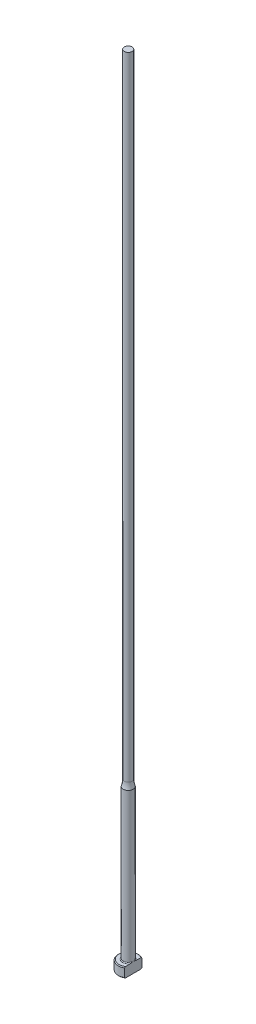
ISO-10303-21;
HEADER;
FILE_DESCRIPTION(('STEP AP214'),'2;1');
FILE_NAME('part.step','',(''),(''),'','','');
FILE_SCHEMA(('AUTOMOTIVE_DESIGN { 1 0 10303 214 1 1 1 1 }'));
ENDSEC;
DATA;
#1=APPLICATION_CONTEXT('core data for automotive mechanical design processes');
#2=APPLICATION_PROTOCOL_DEFINITION('international standard','automotive_design',2000,#1);
#3=PRODUCT_CONTEXT('',#1,'mechanical');
#4=PRODUCT('Part','Part','',(#3));
#5=PRODUCT_RELATED_PRODUCT_CATEGORY('part','',(#4));
#6=PRODUCT_DEFINITION_FORMATION('','',#4);
#7=PRODUCT_DEFINITION_CONTEXT('part definition',#1,'design');
#8=PRODUCT_DEFINITION('design','',#6,#7);
#9=PRODUCT_DEFINITION_SHAPE('','',#8);
#10=(LENGTH_UNIT() NAMED_UNIT(*) SI_UNIT(.MILLI.,.METRE.));
#11=(NAMED_UNIT(*) PLANE_ANGLE_UNIT() SI_UNIT($,.RADIAN.));
#12=(NAMED_UNIT(*) SI_UNIT($,.STERADIAN.) SOLID_ANGLE_UNIT());
#13=UNCERTAINTY_MEASURE_WITH_UNIT(LENGTH_MEASURE(1.E-05),#10,'distance_accuracy_value','');
#14=(GEOMETRIC_REPRESENTATION_CONTEXT(3) GLOBAL_UNCERTAINTY_ASSIGNED_CONTEXT((#13)) GLOBAL_UNIT_ASSIGNED_CONTEXT((#10,
#11,#12)) REPRESENTATION_CONTEXT('',''));
#15=CARTESIAN_POINT('',(0.,0.,0.));
#16=DIRECTION('',(0.,0.,1.));
#17=DIRECTION('',(1.,0.,0.));
#18=AXIS2_PLACEMENT_3D('',#15,#16,#17);
#19=CARTESIAN_POINT('',(-3.17499999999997,3.175,0.));
#20=DIRECTION('',(0.,1.,0.));
#21=DIRECTION('',(0.,0.,1.));
#22=AXIS2_PLACEMENT_3D('',#19,#20,#21);
#23=PLANE('',#22);
#24=CARTESIAN_POINT('',(0.,3.175,0.));
#25=DIRECTION('',(0.,1.,0.));
#26=DIRECTION('',(0.,0.,1.));
#27=AXIS2_PLACEMENT_3D('',#24,#25,#26);
#28=CIRCLE('',#27,2.92099999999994);
#29=CARTESIAN_POINT('',(1.58749999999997,3.175,-2.45195529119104));
#30=VERTEX_POINT('',#29);
#31=CARTESIAN_POINT('',(1.58749999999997,3.175,2.45195529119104));
#32=VERTEX_POINT('',#31);
#33=EDGE_CURVE('E105',#30,#32,#28,.T.);
#34=ORIENTED_EDGE('',*,*,#33,.T.);
#35=DIRECTION('',(0.,0.,1.));
#36=VECTOR('',#35,1.);
#37=CARTESIAN_POINT('',(1.58749999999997,3.17499999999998,2.74963065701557));
#38=LINE('',#37,#36);
#39=CARTESIAN_POINT('',(1.58749999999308,3.175,0.933255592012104));
#40=VERTEX_POINT('',#39);
#41=EDGE_CURVE('E126',#40,#32,#38,.T.);
#42=ORIENTED_EDGE('',*,*,#41,.F.);
#43=CARTESIAN_POINT('',(0.,3.175,0.));
#44=DIRECTION('',(0.,1.,0.));
#45=DIRECTION('',(0.,0.,1.));
#46=AXIS2_PLACEMENT_3D('',#43,#44,#45);
#47=CIRCLE('',#46,1.84149999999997);
#48=CARTESIAN_POINT('',(1.58749999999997,3.17500000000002,-0.933255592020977));
#49=VERTEX_POINT('',#48);
#50=EDGE_CURVE('E11',#40,#49,#47,.F.);
#51=ORIENTED_EDGE('',*,*,#50,.T.);
#52=EDGE_CURVE('E52',#30,#49,#38,.T.);
#53=ORIENTED_EDGE('',*,*,#52,.F.);
#54=EDGE_LOOP('',(#34,#42,#51,#53));
#55=FACE_BOUND('',#54,.T.);
#56=ADVANCED_FACE('F32',(#55),#23,.T.);
#57=CARTESIAN_POINT('',(0.,259.958771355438,0.));
#58=DIRECTION('',(0.,1.,0.));
#59=DIRECTION('',(0.,0.,1.));
#60=AXIS2_PLACEMENT_3D('',#57,#58,#59);
#61=CYLINDRICAL_SURFACE('',#60,3.17499999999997);
#62=CARTESIAN_POINT('',(0.,2.92100000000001,0.));
#63=DIRECTION('',(0.,1.,0.));
#64=DIRECTION('',(0.,0.,1.));
#65=AXIS2_PLACEMENT_3D('',#62,#63,#64);
#66=CIRCLE('',#65,3.17499999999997);
#67=CARTESIAN_POINT('',(1.58749999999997,2.92100000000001,2.74963065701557));
#68=VERTEX_POINT('',#67);
#69=CARTESIAN_POINT('',(1.58749999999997,2.92100000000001,-2.74963065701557));
#70=VERTEX_POINT('',#69);
#71=EDGE_CURVE('E98',#68,#70,#66,.F.);
#72=ORIENTED_EDGE('',*,*,#71,.T.);
#73=DIRECTION('',(0.,-1.,0.));
#74=VECTOR('',#73,1.);
#75=CARTESIAN_POINT('',(1.58749999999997,254.001,-2.74963065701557));
#76=LINE('',#75,#74);
#77=CARTESIAN_POINT('',(1.58749999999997,0.253999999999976,-2.74963065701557));
#78=VERTEX_POINT('',#77);
#79=EDGE_CURVE('E141',#70,#78,#76,.T.);
#80=ORIENTED_EDGE('',*,*,#79,.T.);
#81=CARTESIAN_POINT('',(0.,0.253999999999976,0.));
#82=DIRECTION('',(0.,-1.,0.));
#83=DIRECTION('',(0.,0.,-1.));
#84=AXIS2_PLACEMENT_3D('',#81,#82,#83);
#85=CIRCLE('',#84,3.17499999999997);
#86=CARTESIAN_POINT('',(1.58749999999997,0.253999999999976,2.74963065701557));
#87=VERTEX_POINT('',#86);
#88=EDGE_CURVE('E95',#78,#87,#85,.F.);
#89=ORIENTED_EDGE('',*,*,#88,.T.);
#90=DIRECTION('',(0.,-1.,0.));
#91=VECTOR('',#90,1.);
#92=CARTESIAN_POINT('',(1.58749999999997,254.001,2.74963065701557));
#93=LINE('',#92,#91);
#94=EDGE_CURVE('E88',#68,#87,#93,.T.);
#95=ORIENTED_EDGE('',*,*,#94,.F.);
#96=EDGE_LOOP('',(#72,#80,#89,#95));
#97=FACE_BOUND('',#96,.T.);
#98=ADVANCED_FACE('F191',(#97),#61,.T.);
#99=CARTESIAN_POINT('',(0.,0.,0.));
#100=DIRECTION('',(0.,-1.,0.));
#101=DIRECTION('',(0.,0.,-1.));
#102=AXIS2_PLACEMENT_3D('',#99,#100,#101);
#103=PLANE('',#102);
#104=CARTESIAN_POINT('',(0.,0.,0.));
#105=DIRECTION('',(0.,-1.,0.));
#106=DIRECTION('',(0.,0.,-1.));
#107=AXIS2_PLACEMENT_3D('',#104,#105,#106);
#108=CIRCLE('',#107,2.92100000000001);
#109=CARTESIAN_POINT('',(1.58749999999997,0.,2.45195529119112));
#110=VERTEX_POINT('',#109);
#111=CARTESIAN_POINT('',(1.58749999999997,0.,-2.45195529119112));
#112=VERTEX_POINT('',#111);
#113=EDGE_CURVE('E93',#110,#112,#108,.T.);
#114=ORIENTED_EDGE('',*,*,#113,.T.);
#115=DIRECTION('',(0.,0.,1.));
#116=VECTOR('',#115,1.);
#117=CARTESIAN_POINT('',(1.58749999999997,0.,2.74963065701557));
#118=LINE('',#117,#116);
#119=EDGE_CURVE('E78',#112,#110,#118,.T.);
#120=ORIENTED_EDGE('',*,*,#119,.T.);
#121=EDGE_LOOP('',(#114,#120));
#122=FACE_BOUND('',#121,.T.);
#123=ADVANCED_FACE('F97',(#122),#103,.T.);
#124=CARTESIAN_POINT('',(0.,3.17499999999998,0.));
#125=DIRECTION('',(0.,-1.,0.));
#126=DIRECTION('',(0.,0.,-1.));
#127=AXIS2_PLACEMENT_3D('',#124,#125,#126);
#128=CONICAL_SURFACE('',#127,2.92099999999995,0.785398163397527);
#129=ORIENTED_EDGE('',*,*,#71,.F.);
#130=CARTESIAN_POINT('',(1.58749999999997,-0.16162066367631,-6.0529050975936));
#131=CARTESIAN_POINT('',(1.58749999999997,-0.0288893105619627,-5.91567682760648));
#132=CARTESIAN_POINT('',(1.58749999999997,0.103699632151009,-5.7783103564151));
#133=CARTESIAN_POINT('',(1.58749999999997,0.368508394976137,-5.50321874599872));
#134=CARTESIAN_POINT('',(1.58749999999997,0.500728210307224,-5.36549360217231));
#135=CARTESIAN_POINT('',(1.58749999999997,0.764778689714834,-5.08953516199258));
#136=CARTESIAN_POINT('',(1.58749999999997,0.896609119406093,-4.9513016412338));
#137=CARTESIAN_POINT('',(1.58749999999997,1.15968706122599,-4.67428233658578));
#138=CARTESIAN_POINT('',(1.58749999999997,1.29093457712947,-4.53549655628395));
#139=CARTESIAN_POINT('',(1.58749999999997,1.55007705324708,-4.25997724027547));
#140=CARTESIAN_POINT('',(1.58749999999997,1.67798684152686,-4.12325766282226));
#141=CARTESIAN_POINT('',(1.58749999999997,1.9328486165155,-3.84892898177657));
#142=CARTESIAN_POINT('',(1.58749999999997,2.05980060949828,-3.71131988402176));
#143=CARTESIAN_POINT('',(1.58749999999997,2.31237508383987,-3.43493978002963));
#144=CARTESIAN_POINT('',(1.58749999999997,2.43799784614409,-3.29616903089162));
#145=CARTESIAN_POINT('',(1.58749999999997,2.68741369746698,-3.01699558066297));
#146=CARTESIAN_POINT('',(1.58749999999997,2.81120686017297,-2.8765929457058));
#147=CARTESIAN_POINT('',(1.58749999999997,3.00875865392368,-2.64816703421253));
#148=CARTESIAN_POINT('',(1.58749999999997,3.08336151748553,-2.56087478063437));
#149=CARTESIAN_POINT('',(1.58749999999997,3.2312387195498,-2.38515423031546));
#150=CARTESIAN_POINT('',(1.58749999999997,3.30451292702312,-2.29672582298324));
#151=CARTESIAN_POINT('',(1.58749999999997,3.45004422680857,-2.1174740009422));
#152=CARTESIAN_POINT('',(1.58749999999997,3.5222823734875,-2.02663514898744));
#153=CARTESIAN_POINT('',(1.58749999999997,3.66423097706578,-1.8430252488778));
#154=CARTESIAN_POINT('',(1.58749999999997,3.73394203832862,-1.75025467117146));
#155=CARTESIAN_POINT('',(1.58749999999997,3.87080633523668,-1.5606747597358));
#156=CARTESIAN_POINT('',(1.58749999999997,3.93790459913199,-1.46382547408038));
#157=CARTESIAN_POINT('',(1.58749999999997,4.06669147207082,-1.26632594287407));
#158=CARTESIAN_POINT('',(1.58749999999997,4.1283726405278,-1.16567073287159));
#159=CARTESIAN_POINT('',(1.58749999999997,4.21402252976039,-1.01165766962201));
#160=CARTESIAN_POINT('',(1.58749999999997,4.24127929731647,-0.960142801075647));
#161=CARTESIAN_POINT('',(1.58749999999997,4.2930979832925,-0.855780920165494));
#162=CARTESIAN_POINT('',(1.58749999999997,4.31765941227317,-0.802933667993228));
#163=CARTESIAN_POINT('',(1.58749999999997,4.38614656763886,-0.642461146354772));
#164=CARTESIAN_POINT('',(1.58749999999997,4.42510149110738,-0.532518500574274));
#165=CARTESIAN_POINT('',(1.58749999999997,4.46726244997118,-0.367680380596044));
#166=CARTESIAN_POINT('',(1.58749999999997,4.47844427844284,-0.314802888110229));
#167=CARTESIAN_POINT('',(1.58749999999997,4.49576654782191,-0.208209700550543));
#168=CARTESIAN_POINT('',(1.58749999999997,4.50190743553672,-0.154494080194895));
#169=CARTESIAN_POINT('',(1.58749999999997,4.50871296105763,-0.0468792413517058));
#170=CARTESIAN_POINT('',(1.58749999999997,4.5093945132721,0.00701889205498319));
#171=CARTESIAN_POINT('',(1.58749999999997,4.50527679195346,0.114606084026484));
#172=CARTESIAN_POINT('',(1.58749999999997,4.50047706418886,0.168295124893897));
#173=CARTESIAN_POINT('',(1.58749999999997,4.48579689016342,0.27448544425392));
#174=CARTESIAN_POINT('',(1.58749999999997,4.47596081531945,0.32699298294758));
#175=CARTESIAN_POINT('',(1.58749999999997,4.45181809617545,0.430974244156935));
#176=CARTESIAN_POINT('',(1.58749999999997,4.4375096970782,0.482447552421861));
#177=CARTESIAN_POINT('',(1.58749999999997,4.40502489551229,0.584460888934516));
#178=CARTESIAN_POINT('',(1.58749999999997,4.386827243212,0.634994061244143));
#179=CARTESIAN_POINT('',(1.58749999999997,4.34729308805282,0.734789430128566));
#180=CARTESIAN_POINT('',(1.58749999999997,4.3259572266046,0.784051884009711));
#181=CARTESIAN_POINT('',(1.58749999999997,4.25791922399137,0.930549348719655));
#182=CARTESIAN_POINT('',(1.58749999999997,4.20736047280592,1.0259880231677));
#183=CARTESIAN_POINT('',(1.58749999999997,4.0995545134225,1.21304313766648));
#184=CARTESIAN_POINT('',(1.58749999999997,4.04229912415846,1.30465471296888));
#185=CARTESIAN_POINT('',(1.58749999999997,3.92308746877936,1.48526211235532));
#186=CARTESIAN_POINT('',(1.58749999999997,3.86111349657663,1.57424615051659));
#187=CARTESIAN_POINT('',(1.58749999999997,3.73408621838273,1.74990003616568));
#188=CARTESIAN_POINT('',(1.58749999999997,3.66903444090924,1.83657099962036));
#189=CARTESIAN_POINT('',(1.58749999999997,3.53583371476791,2.00931764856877));
#190=CARTESIAN_POINT('',(1.58749999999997,3.46765527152,2.09537048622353));
#191=CARTESIAN_POINT('',(1.58749999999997,3.32960643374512,2.26611736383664));
#192=CARTESIAN_POINT('',(1.58749999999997,3.25973586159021,2.35081125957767));
#193=CARTESIAN_POINT('',(1.58749999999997,3.04858139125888,2.60290121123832));
#194=CARTESIAN_POINT('',(1.58749999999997,2.90542388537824,2.76872537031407));
#195=CARTESIAN_POINT('',(1.58749999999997,2.64069522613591,3.06970913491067));
#196=CARTESIAN_POINT('',(1.58749999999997,2.51959458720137,3.20528660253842));
#197=CARTESIAN_POINT('',(1.58749999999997,2.27590400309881,3.47510321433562));
#198=CARTESIAN_POINT('',(1.58749999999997,2.15331401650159,3.60934232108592));
#199=CARTESIAN_POINT('',(1.58749999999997,1.90694239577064,3.87695374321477));
#200=CARTESIAN_POINT('',(1.58749999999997,1.78315974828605,4.0103251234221));
#201=CARTESIAN_POINT('',(1.58749999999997,1.53478104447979,4.27630880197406));
#202=CARTESIAN_POINT('',(1.58749999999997,1.41018498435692,4.40892109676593));
#203=CARTESIAN_POINT('',(1.58749999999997,1.0457468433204,4.79499418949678));
#204=CARTESIAN_POINT('',(1.58749999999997,0.80507680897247,5.04767313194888));
#205=CARTESIAN_POINT('',(1.58749999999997,0.443121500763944,5.42550911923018));
#206=CARTESIAN_POINT('',(1.58749999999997,0.322378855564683,5.55118772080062));
#207=CARTESIAN_POINT('',(1.58749999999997,0.0805914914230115,5.80225207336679));
#208=CARTESIAN_POINT('',(1.58749999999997,-0.040453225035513,5.92763782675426));
#209=CARTESIAN_POINT('',(1.58749999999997,-0.161620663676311,6.0529050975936));
#210=B_SPLINE_CURVE_WITH_KNOTS('',3,(#130,#131,#132,#133,#134,#135,#136,#137,#138,#139,#140,
#141,#142,#143,#144,#145,#146,#147,#148,#149,#150,#151,#152,#153,#154,#155,#156,#157,#158,#159,
#160,#161,#162,#163,#164,#165,#166,#167,#168,#169,#170,#171,#172,#173,#174,#175,#176,#177,#178,
#179,#180,#181,#182,#183,#184,#185,#186,#187,#188,#189,#190,#191,#192,#193,#194,#195,#196,#197,
#198,#199,#200,#201,#202,#203,#204,#205,#206,#207,#208,#209),.UNSPECIFIED.,.F.,.F.,(4,2,2,2,2,2,
2,2,2,2,2,2,2,2,2,2,2,2,2,2,2,2,2,2,2,2,2,2,2,2,2,2,2,2,2,2,2,2,2,4),(0.,0.572750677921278,
1.14550874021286,1.71856057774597,2.29160869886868,2.85328006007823,3.4149477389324,
3.97649423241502,4.53801804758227,4.88249307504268,5.22700189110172,5.5751532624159,
5.92322081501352,6.27657800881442,6.63041319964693,6.80518126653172,6.9799810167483,
7.3282426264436,7.49018491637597,7.65211285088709,7.81353889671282,7.97497832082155,
8.13501929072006,8.29512313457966,8.45612518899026,8.61709438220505,8.94062993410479,
9.2645649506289,9.58978187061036,9.91483894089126,10.2441741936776,10.5735441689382,
11.2306812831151,11.7760337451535,12.3214014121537,12.8672825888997,13.4131663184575,
14.4600164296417,14.9828595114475,15.5056983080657),.UNSPECIFIED.);
#211=EDGE_CURVE('E118',#32,#68,#210,.T.);
#212=ORIENTED_EDGE('',*,*,#211,.F.);
#213=ORIENTED_EDGE('',*,*,#33,.F.);
#214=EDGE_CURVE('E117',#70,#30,#210,.T.);
#215=ORIENTED_EDGE('',*,*,#214,.F.);
#216=EDGE_LOOP('',(#129,#212,#213,#215));
#217=FACE_BOUND('',#216,.T.);
#218=ADVANCED_FACE('F162',(#217),#128,.T.);
#219=CARTESIAN_POINT('',(0.,0.253999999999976,0.));
#220=DIRECTION('',(0.,1.,0.));
#221=DIRECTION('',(0.,0.,1.));
#222=AXIS2_PLACEMENT_3D('',#219,#220,#221);
#223=CONICAL_SURFACE('',#222,3.17499999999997,0.785398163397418);
#224=ORIENTED_EDGE('',*,*,#88,.F.);
#225=CARTESIAN_POINT('',(1.58749999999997,3.33662066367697,6.0529050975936));
#226=CARTESIAN_POINT('',(1.58749999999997,3.20388931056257,5.91567682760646));
#227=CARTESIAN_POINT('',(1.58749999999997,3.07130036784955,5.77831035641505));
#228=CARTESIAN_POINT('',(1.58749999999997,2.80649160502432,5.50321874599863));
#229=CARTESIAN_POINT('',(1.58749999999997,2.67427178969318,5.3654936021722));
#230=CARTESIAN_POINT('',(1.58749999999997,2.41022131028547,5.08953516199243));
#231=CARTESIAN_POINT('',(1.58749999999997,2.27839088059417,4.95130164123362));
#232=CARTESIAN_POINT('',(1.58749999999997,2.01531293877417,4.67428233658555));
#233=CARTESIAN_POINT('',(1.58749999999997,1.88406542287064,4.5354965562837));
#234=CARTESIAN_POINT('',(1.58749999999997,1.62492294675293,4.25997724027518));
#235=CARTESIAN_POINT('',(1.58749999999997,1.49701315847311,4.12325766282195));
#236=CARTESIAN_POINT('',(1.58749999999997,1.24215138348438,3.84892898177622));
#237=CARTESIAN_POINT('',(1.58749999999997,1.11519939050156,3.71131988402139));
#238=CARTESIAN_POINT('',(1.58749999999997,0.862624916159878,3.43493978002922));
#239=CARTESIAN_POINT('',(1.58749999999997,0.737002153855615,3.29616903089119));
#240=CARTESIAN_POINT('',(1.58749999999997,0.487586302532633,3.01699558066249));
#241=CARTESIAN_POINT('',(1.58749999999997,0.363793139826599,2.8765929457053));
#242=CARTESIAN_POINT('',(1.58749999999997,0.166241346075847,2.64816703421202));
#243=CARTESIAN_POINT('',(1.58749999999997,0.0916384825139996,2.56087478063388));
#244=CARTESIAN_POINT('',(1.58749999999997,-0.0562387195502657,2.385154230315));
#245=CARTESIAN_POINT('',(1.58749999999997,-0.129512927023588,2.29672582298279));
#246=CARTESIAN_POINT('',(1.58749999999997,-0.27504422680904,2.11747400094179));
#247=CARTESIAN_POINT('',(1.58749999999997,-0.347282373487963,2.02663514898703));
#248=CARTESIAN_POINT('',(1.58749999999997,-0.489230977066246,1.84302524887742));
#249=CARTESIAN_POINT('',(1.58749999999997,-0.558942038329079,1.7502546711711));
#250=CARTESIAN_POINT('',(1.58749999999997,-0.695806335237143,1.56067475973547));
#251=CARTESIAN_POINT('',(1.58749999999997,-0.762904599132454,1.46382547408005));
#252=CARTESIAN_POINT('',(1.58749999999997,-0.891691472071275,1.26632594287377));
#253=CARTESIAN_POINT('',(1.58749999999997,-0.953372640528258,1.16567073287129));
#254=CARTESIAN_POINT('',(1.58749999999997,-1.03902252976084,1.01165766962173));
#255=CARTESIAN_POINT('',(1.58749999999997,-1.06627929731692,0.960142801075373));
#256=CARTESIAN_POINT('',(1.58749999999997,-1.11809798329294,0.85578092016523));
#257=CARTESIAN_POINT('',(1.58749999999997,-1.14265941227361,0.802933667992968));
#258=CARTESIAN_POINT('',(1.58749999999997,-1.21114656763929,0.642461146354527));
#259=CARTESIAN_POINT('',(1.58749999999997,-1.2501014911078,0.532518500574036));
#260=CARTESIAN_POINT('',(1.58749999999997,-1.29226244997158,0.367680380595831));
#261=CARTESIAN_POINT('',(1.58749999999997,-1.30344427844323,0.314802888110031));
#262=CARTESIAN_POINT('',(1.58749999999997,-1.32076654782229,0.208209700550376));
#263=CARTESIAN_POINT('',(1.58749999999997,-1.3269074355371,0.154494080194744));
#264=CARTESIAN_POINT('',(1.58749999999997,-1.333712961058,0.0468792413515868));
#265=CARTESIAN_POINT('',(1.58749999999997,-1.33439451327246,-0.00701889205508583));
#266=CARTESIAN_POINT('',(1.58749999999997,-1.33027679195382,-0.114606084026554));
#267=CARTESIAN_POINT('',(1.58749999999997,-1.32547706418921,-0.168295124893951));
#268=CARTESIAN_POINT('',(1.58749999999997,-1.31079689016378,-0.274485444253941));
#269=CARTESIAN_POINT('',(1.58749999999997,-1.3009608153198,-0.326992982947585));
#270=CARTESIAN_POINT('',(1.58749999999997,-1.27681809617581,-0.430974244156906));
#271=CARTESIAN_POINT('',(1.58749999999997,-1.26250969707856,-0.482447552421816));
#272=CARTESIAN_POINT('',(1.58749999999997,-1.23002489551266,-0.584460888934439));
#273=CARTESIAN_POINT('',(1.58749999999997,-1.21182724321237,-0.634994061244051));
#274=CARTESIAN_POINT('',(1.58749999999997,-1.1722930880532,-0.734789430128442));
#275=CARTESIAN_POINT('',(1.58749999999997,-1.15095722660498,-0.784051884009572));
#276=CARTESIAN_POINT('',(1.58749999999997,-1.08291922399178,-0.93054934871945));
#277=CARTESIAN_POINT('',(1.58749999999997,-1.03236047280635,-1.02598802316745));
#278=CARTESIAN_POINT('',(1.58749999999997,-0.924554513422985,-1.21304313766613));
#279=CARTESIAN_POINT('',(1.58749999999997,-0.86729912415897,-1.30465471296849));
#280=CARTESIAN_POINT('',(1.58749999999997,-0.748087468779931,-1.48526211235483));
#281=CARTESIAN_POINT('',(1.58749999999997,-0.686113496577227,-1.57424615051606));
#282=CARTESIAN_POINT('',(1.58749999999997,-0.55908621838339,-1.74990003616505));
#283=CARTESIAN_POINT('',(1.58749999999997,-0.494034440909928,-1.83657099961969));
#284=CARTESIAN_POINT('',(1.58749999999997,-0.360833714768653,-2.00931764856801));
#285=CARTESIAN_POINT('',(1.58749999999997,-0.292655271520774,-2.09537048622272));
#286=CARTESIAN_POINT('',(1.58749999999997,-0.154606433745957,-2.26611736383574));
#287=CARTESIAN_POINT('',(1.58749999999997,-0.0847358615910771,-2.35081125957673));
#288=CARTESIAN_POINT('',(1.58749999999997,0.126418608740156,-2.60290121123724));
#289=CARTESIAN_POINT('',(1.58749999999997,0.269576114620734,-2.76872537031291));
#290=CARTESIAN_POINT('',(1.58749999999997,0.534304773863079,-3.06970913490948));
#291=CARTESIAN_POINT('',(1.58749999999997,0.655405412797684,-3.20528660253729));
#292=CARTESIAN_POINT('',(1.58749999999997,0.899095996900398,-3.47510321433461));
#293=CARTESIAN_POINT('',(1.58749999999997,1.02168598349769,-3.60934232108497));
#294=CARTESIAN_POINT('',(1.58749999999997,1.26805760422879,-3.87695374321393));
#295=CARTESIAN_POINT('',(1.58749999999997,1.39184025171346,-4.01032512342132));
#296=CARTESIAN_POINT('',(1.58749999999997,1.64021895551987,-4.2763088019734));
#297=CARTESIAN_POINT('',(1.58749999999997,1.76481501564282,-4.40892109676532));
#298=CARTESIAN_POINT('',(1.58749999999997,2.12925315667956,-4.79499418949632));
#299=CARTESIAN_POINT('',(1.58749999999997,2.36992319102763,-5.04767313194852));
#300=CARTESIAN_POINT('',(1.58749999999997,2.73187849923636,-5.42550911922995));
#301=CARTESIAN_POINT('',(1.58749999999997,2.85262114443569,-5.55118772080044));
#302=CARTESIAN_POINT('',(1.58749999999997,3.09440850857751,-5.8022520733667));
#303=CARTESIAN_POINT('',(1.58749999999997,3.2154532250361,-5.92763782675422));
#304=CARTESIAN_POINT('',(1.58749999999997,3.33662066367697,-6.0529050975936));
#305=B_SPLINE_CURVE_WITH_KNOTS('',3,(#225,#226,#227,#228,#229,#230,#231,#232,#233,#234,#235,
#236,#237,#238,#239,#240,#241,#242,#243,#244,#245,#246,#247,#248,#249,#250,#251,#252,#253,#254,
#255,#256,#257,#258,#259,#260,#261,#262,#263,#264,#265,#266,#267,#268,#269,#270,#271,#272,#273,
#274,#275,#276,#277,#278,#279,#280,#281,#282,#283,#284,#285,#286,#287,#288,#289,#290,#291,#292,
#293,#294,#295,#296,#297,#298,#299,#300,#301,#302,#303,#304),.UNSPECIFIED.,.F.,.F.,(4,2,2,2,2,2,
2,2,2,2,2,2,2,2,2,2,2,2,2,2,2,2,2,2,2,2,2,2,2,2,2,2,2,2,2,2,2,2,2,4),(0.,0.57275067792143,
1.14550874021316,1.71856057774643,2.29160869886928,2.85328006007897,3.41494773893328,
3.97649423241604,4.53801804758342,4.88249307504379,5.2270018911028,5.57515326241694,
5.92322081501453,6.27657800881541,6.63041319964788,6.80518126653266,6.97998101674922,
7.32824262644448,7.49018491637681,7.65211285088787,7.81353889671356,7.97497832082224,
8.1350192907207,8.29512313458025,8.45612518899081,8.61709438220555,8.94062993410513,
9.26456495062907,9.58978187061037,9.91483894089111,10.2441741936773,10.5735441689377,
11.2306812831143,11.776033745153,12.3214014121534,12.8672825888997,13.4131663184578,
14.4600164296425,14.9828595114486,15.505698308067),.UNSPECIFIED.);
#306=EDGE_CURVE('E81',#112,#78,#305,.T.);
#307=ORIENTED_EDGE('',*,*,#306,.F.);
#308=ORIENTED_EDGE('',*,*,#113,.F.);
#309=EDGE_CURVE('E84',#87,#110,#305,.T.);
#310=ORIENTED_EDGE('',*,*,#309,.F.);
#311=EDGE_LOOP('',(#224,#307,#308,#310));
#312=FACE_BOUND('',#311,.T.);
#313=ADVANCED_FACE('F92',(#312),#223,.T.);
#314=CARTESIAN_POINT('',(0.,3.42900000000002,0.));
#315=DIRECTION('',(0.,1.,0.));
#316=DIRECTION('',(0.,0.,1.));
#317=AXIS2_PLACEMENT_3D('',#314,#315,#316);
#318=TOROIDAL_SURFACE('',#317,1.84149999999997,0.254);
#319=CARTESIAN_POINT('',(1.58749999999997,3.42900000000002,0.));
#320=CARTESIAN_POINT('',(1.58749999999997,3.42899942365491,-1.9220514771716E-10));
#321=CARTESIAN_POINT('',(1.58749999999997,3.42899884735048,-1.2261161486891E-07));
#322=CARTESIAN_POINT('',(1.58749999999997,3.42899773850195,-5.09676365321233E-07));
#323=CARTESIAN_POINT('',(1.58749999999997,3.42899720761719,-7.78176328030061E-07));
#324=CARTESIAN_POINT('',(1.58749999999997,3.42899614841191,-1.42307272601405E-06));
#325=CARTESIAN_POINT('',(1.58749999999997,3.42899562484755,-1.80713867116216E-06));
#326=CARTESIAN_POINT('',(1.58749999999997,3.42899463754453,-2.63494846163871E-06));
#327=CARTESIAN_POINT('',(1.58749999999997,3.42899417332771,-3.07814756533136E-06));
#328=CARTESIAN_POINT('',(1.58749999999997,3.42899261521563,-4.66897357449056E-06));
#329=CARTESIAN_POINT('',(1.58749999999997,3.42899159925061,-5.89404908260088E-06));
#330=CARTESIAN_POINT('',(1.58749999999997,3.42898979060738,-8.42427511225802E-06));
#331=CARTESIAN_POINT('',(1.58749999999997,3.42898899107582,-9.7248057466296E-06));
#332=CARTESIAN_POINT('',(1.58749999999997,3.42898598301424,-1.48060601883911E-05));
#333=CARTESIAN_POINT('',(1.58749999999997,3.42898393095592,-1.86838281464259E-05));
#334=CARTESIAN_POINT('',(1.58749999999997,3.42898057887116,-2.63261117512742E-05));
#335=CARTESIAN_POINT('',(1.58749999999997,3.42897922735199,-3.00687417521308E-05));
#336=CARTESIAN_POINT('',(1.58749999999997,3.42897347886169,-4.60276298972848E-05));
#337=CARTESIAN_POINT('',(1.58749999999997,3.42896911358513,-5.8247019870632E-05));
#338=CARTESIAN_POINT('',(1.58749999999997,3.42896211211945,-8.11070097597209E-05));
#339=CARTESIAN_POINT('',(1.58749999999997,3.42895931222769,-9.16953114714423E-05));
#340=CARTESIAN_POINT('',(1.58749999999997,3.42893712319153,-0.000168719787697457));
#341=CARTESIAN_POINT('',(1.58749999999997,3.42890881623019,-0.000232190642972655));
#342=CARTESIAN_POINT('',(1.58749999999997,3.42880276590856,-0.000479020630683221));
#343=CARTESIAN_POINT('',(1.58749999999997,3.42873165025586,-0.00066443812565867));
#344=CARTESIAN_POINT('',(1.58749999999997,3.42845137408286,-0.0013844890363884));
#345=CARTESIAN_POINT('',(1.58749999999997,3.42823526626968,-0.00191701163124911));
#346=CARTESIAN_POINT('',(1.58749999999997,3.42735449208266,-0.00409774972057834));
#347=CARTESIAN_POINT('',(1.58749999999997,3.42669768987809,-0.00574830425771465));
#348=CARTESIAN_POINT('',(1.58749999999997,3.4174405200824,-0.0289985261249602));
#349=CARTESIAN_POINT('',(1.58749999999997,3.40878325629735,-0.0505816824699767));
#350=CARTESIAN_POINT('',(1.58749999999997,3.39189297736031,-0.0929947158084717));
#351=CARTESIAN_POINT('',(1.58749999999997,3.38365605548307,-0.11382315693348));
#352=CARTESIAN_POINT('',(1.58749999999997,3.36635393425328,-0.157956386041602));
#353=CARTESIAN_POINT('',(1.58749999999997,3.35730391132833,-0.181267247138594));
#354=CARTESIAN_POINT('',(1.58749999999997,3.33936775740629,-0.228222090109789));
#355=CARTESIAN_POINT('',(1.58749999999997,3.33048420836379,-0.25186705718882));
#356=CARTESIAN_POINT('',(1.58749999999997,3.30894496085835,-0.310512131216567));
#357=CARTESIAN_POINT('',(1.58749999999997,3.29649449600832,-0.345588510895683));
#358=CARTESIAN_POINT('',(1.58749999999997,3.27296975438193,-0.415278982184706));
#359=CARTESIAN_POINT('',(1.58749999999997,3.26186987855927,-0.449884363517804));
#360=CARTESIAN_POINT('',(1.58749999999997,3.2395832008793,-0.524471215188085));
#361=CARTESIAN_POINT('',(1.58749999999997,3.22860862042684,-0.564517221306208));
#362=CARTESIAN_POINT('',(1.58749999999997,3.20902534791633,-0.645529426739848));
#363=CARTESIAN_POINT('',(1.58749999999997,3.20043582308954,-0.686500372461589));
#364=CARTESIAN_POINT('',(1.58749999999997,3.18611712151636,-0.771546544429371));
#365=CARTESIAN_POINT('',(1.58749999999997,3.18059550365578,-0.815658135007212));
#366=CARTESIAN_POINT('',(1.58749999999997,3.17455396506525,-0.904117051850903));
#367=CARTESIAN_POINT('',(1.58749999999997,3.17401361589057,-0.948462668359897));
#368=CARTESIAN_POINT('',(1.58749999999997,3.17898948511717,-1.02531896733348));
#369=CARTESIAN_POINT('',(1.58749999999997,3.1829739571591,-1.05792141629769));
#370=CARTESIAN_POINT('',(1.58749999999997,3.19569167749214,-1.12184393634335));
#371=CARTESIAN_POINT('',(1.58749999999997,3.20436049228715,-1.1531753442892));
#372=CARTESIAN_POINT('',(1.58749999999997,3.22236152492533,-1.19946468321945));
#373=CARTESIAN_POINT('',(1.58749999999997,3.2295150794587,-1.21526783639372));
#374=CARTESIAN_POINT('',(1.58749999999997,3.24587062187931,-1.24583726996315));
#375=CARTESIAN_POINT('',(1.58749999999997,3.25507530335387,-1.26060215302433));
#376=CARTESIAN_POINT('',(1.58749999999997,3.27378481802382,-1.28575815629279));
#377=CARTESIAN_POINT('',(1.58749999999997,3.28289001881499,-1.29644383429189));
#378=CARTESIAN_POINT('',(1.58749999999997,3.30268460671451,-1.31623154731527));
#379=CARTESIAN_POINT('',(1.58749999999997,3.31337067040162,-1.32533681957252));
#380=CARTESIAN_POINT('',(1.58749999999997,3.33349977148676,-1.33941140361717));
#381=CARTESIAN_POINT('',(1.58749999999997,3.34261446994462,-1.34484814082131));
#382=CARTESIAN_POINT('',(1.58749999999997,3.36161455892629,-1.35416329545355));
#383=CARTESIAN_POINT('',(1.58749999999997,3.37149946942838,-1.35804267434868));
#384=CARTESIAN_POINT('',(1.58749999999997,3.39188678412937,-1.36398436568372));
#385=CARTESIAN_POINT('',(1.58749999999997,3.40239309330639,-1.36603350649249));
#386=CARTESIAN_POINT('',(1.58749999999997,3.42360372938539,-1.3680840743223));
#387=CARTESIAN_POINT('',(1.58749999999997,3.43430795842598,-1.36808648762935));
#388=CARTESIAN_POINT('',(1.58749999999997,3.45433283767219,-1.36616208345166));
#389=CARTESIAN_POINT('',(1.58749999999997,3.46367506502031,-1.36444960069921));
#390=CARTESIAN_POINT('',(1.58749999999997,3.48195519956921,-1.35953338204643));
#391=CARTESIAN_POINT('',(1.58749999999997,3.49089304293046,-1.3563294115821));
#392=CARTESIAN_POINT('',(1.58749999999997,3.50850302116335,-1.34848006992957));
#393=CARTESIAN_POINT('',(1.58749999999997,3.5171531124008,-1.34378578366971));
#394=CARTESIAN_POINT('',(1.58749999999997,3.53371257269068,-1.33324445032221));
#395=CARTESIAN_POINT('',(1.58749999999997,3.54162163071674,-1.32739692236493));
#396=CARTESIAN_POINT('',(1.58749999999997,3.56107121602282,-1.31107304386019));
#397=CARTESIAN_POINT('',(1.58749999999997,3.57202221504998,-1.29989286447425));
#398=CARTESIAN_POINT('',(1.58749999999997,3.59202509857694,-1.27593566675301));
#399=CARTESIAN_POINT('',(1.58749999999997,3.60107086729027,-1.26315370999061));
#400=CARTESIAN_POINT('',(1.58749999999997,3.62186023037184,-1.22930733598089));
#401=CARTESIAN_POINT('',(1.58749999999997,3.63240584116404,-1.20751096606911));
#402=CARTESIAN_POINT('',(1.58749999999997,3.65004643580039,-1.16266144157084));
#403=CARTESIAN_POINT('',(1.58749999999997,3.65714435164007,-1.13960937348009));
#404=CARTESIAN_POINT('',(1.58749999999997,3.67265428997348,-1.07603916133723));
#405=CARTESIAN_POINT('',(1.58749999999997,3.67834921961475,-1.03486686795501));
#406=CARTESIAN_POINT('',(1.58749999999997,3.68382880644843,-0.951558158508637));
#407=CARTESIAN_POINT('',(1.58749999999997,3.68350976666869,-0.909417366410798));
#408=CARTESIAN_POINT('',(1.58749999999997,3.67745397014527,-0.811383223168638));
#409=CARTESIAN_POINT('',(1.58749999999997,3.66993873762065,-0.755610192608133));
#410=CARTESIAN_POINT('',(1.58749999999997,3.64933373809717,-0.644937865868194));
#411=CARTESIAN_POINT('',(1.58749999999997,3.63621897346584,-0.59004364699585));
#412=CARTESIAN_POINT('',(1.58749999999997,3.60740922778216,-0.485757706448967));
#413=CARTESIAN_POINT('',(1.58749999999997,3.59201096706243,-0.436281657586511));
#414=CARTESIAN_POINT('',(1.58749999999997,3.55922497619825,-0.338551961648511));
#415=CARTESIAN_POINT('',(1.58749999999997,3.5418584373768,-0.290291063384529));
#416=CARTESIAN_POINT('',(1.58749999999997,3.51760237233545,-0.225557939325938));
#417=CARTESIAN_POINT('',(1.58749999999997,3.51126413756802,-0.208874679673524));
#418=CARTESIAN_POINT('',(1.58749999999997,3.49830042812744,-0.17512392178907));
#419=CARTESIAN_POINT('',(1.58749999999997,3.49167176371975,-0.158057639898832));
#420=CARTESIAN_POINT('',(1.58749999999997,3.47585523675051,-0.117638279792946));
#421=CARTESIAN_POINT('',(1.58749999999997,3.46662970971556,-0.0943002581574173));
#422=CARTESIAN_POINT('',(1.58749999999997,3.44889695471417,-0.0497824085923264));
#423=CARTESIAN_POINT('',(1.58749999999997,3.44040039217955,-0.028598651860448));
#424=CARTESIAN_POINT('',(1.58749999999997,3.43130364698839,-0.00575168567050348));
#425=CARTESIAN_POINT('',(1.58749999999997,3.43064818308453,-0.00410451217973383));
#426=CARTESIAN_POINT('',(1.58749999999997,3.42976776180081,-0.00192459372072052));
#427=CARTESIAN_POINT('',(1.58749999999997,3.42955062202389,-0.00138952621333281));
#428=CARTESIAN_POINT('',(1.58749999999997,3.42926908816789,-0.000666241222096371));
#429=CARTESIAN_POINT('',(1.58749999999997,3.42919771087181,-0.000480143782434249));
#430=CARTESIAN_POINT('',(1.58749999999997,3.42909131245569,-0.000232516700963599));
#431=CARTESIAN_POINT('',(1.58749999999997,3.42906294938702,-0.000168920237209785));
#432=CARTESIAN_POINT('',(1.58749999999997,3.42904072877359,-9.17527162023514E-05));
#433=CARTESIAN_POINT('',(1.58749999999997,3.42903792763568,-8.11550293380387E-05));
#434=CARTESIAN_POINT('',(1.58749999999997,3.42903091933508,-5.82743948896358E-05));
#435=CARTESIAN_POINT('',(1.58749999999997,3.42902654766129,-4.60440001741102E-05));
#436=CARTESIAN_POINT('',(1.58749999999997,3.42902079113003,-3.00727682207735E-05));
#437=CARTESIAN_POINT('',(1.58749999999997,3.42901943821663,-2.63286807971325E-05));
#438=CARTESIAN_POINT('',(1.58749999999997,3.42901608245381,-1.86836529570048E-05));
#439=CARTESIAN_POINT('',(1.58749999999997,3.4290140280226,-1.48046517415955E-05));
#440=CARTESIAN_POINT('',(1.58749999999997,3.42901101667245,-9.72223943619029E-06));
#441=CARTESIAN_POINT('',(1.58749999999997,3.42901021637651,-8.42159649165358E-06));
#442=CARTESIAN_POINT('',(1.58749999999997,3.42900840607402,-5.89129729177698E-06));
#443=CARTESIAN_POINT('',(1.58749999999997,3.42900738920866,-4.66626867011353E-06));
#444=CARTESIAN_POINT('',(1.58749999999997,3.42900582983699,-3.07568803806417E-06));
#445=CARTESIAN_POINT('',(1.58749999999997,3.42900536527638,-2.63259565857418E-06));
#446=CARTESIAN_POINT('',(1.58749999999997,3.4290043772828,-1.80506085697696E-06));
#447=CARTESIAN_POINT('',(1.58749999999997,3.42900385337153,-1.42116387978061E-06));
#448=CARTESIAN_POINT('',(1.58749999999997,3.42900279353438,-7.76675643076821E-07));
#449=CARTESIAN_POINT('',(1.58749999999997,3.42900226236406,-5.08406487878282E-07));
#450=CARTESIAN_POINT('',(1.58749999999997,3.42900115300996,-1.21901887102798E-07));
#451=CARTESIAN_POINT('',(1.58749999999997,3.42900057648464,1.92251677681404E-10));
#452=CARTESIAN_POINT('',(1.58749999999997,3.42900000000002,0.));
#453=B_SPLINE_CURVE_WITH_KNOTS('',3,(#319,#320,#321,#322,#323,#324,#325,#326,#327,#328,#329,
#330,#331,#332,#333,#334,#335,#336,#337,#338,#339,#340,#341,#342,#343,#344,#345,#346,#347,#348,
#349,#350,#351,#352,#353,#354,#355,#356,#357,#358,#359,#360,#361,#362,#363,#364,#365,#366,#367,
#368,#369,#370,#371,#372,#373,#374,#375,#376,#377,#378,#379,#380,#381,#382,#383,#384,#385,#386,
#387,#388,#389,#390,#391,#392,#393,#394,#395,#396,#397,#398,#399,#400,#401,#402,#403,#404,#405,
#406,#407,#408,#409,#410,#411,#412,#413,#414,#415,#416,#417,#418,#419,#420,#421,#422,#423,#424,
#425,#426,#427,#428,#429,#430,#431,#432,#433,#434,#435,#436,#437,#438,#439,#440,#441,#442,#443,
#444,#445,#446,#447,#448,#449,#450,#451,#452),.UNSPECIFIED.,.T.,.F.,(4,2,2,2,2,2,2,2,2,2,2,2,2,
2,2,2,2,2,2,2,2,2,2,2,2,2,2,2,2,2,2,2,2,2,2,2,2,2,2,2,2,2,2,2,2,2,2,2,2,2,2,2,2,2,2,2,2,2,2,2,2,
2,2,2,2,2,4),(0.,1.72815458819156E-06,3.50429255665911E-06,5.44431004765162E-06,
7.3675525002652E-06,1.2119089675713E-05,1.66953775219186E-05,2.98160400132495E-05,
4.17409564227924E-05,8.0660475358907E-05,0.000113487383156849,0.000321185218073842,
0.000917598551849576,0.00264089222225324,0.00797105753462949,0.0777276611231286,
0.144923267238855,0.219939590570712,0.295714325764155,0.407362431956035,0.516367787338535,
0.640878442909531,0.766362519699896,0.899536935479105,1.03216495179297,1.13045740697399,
1.22743103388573,1.27935899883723,1.33135556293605,1.37333248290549,1.41522237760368,
1.44693946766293,1.47863694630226,1.51056074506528,1.54246916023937,1.57083210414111,
1.59919951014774,1.62861579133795,1.65804436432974,1.70472658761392,1.75155645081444,
1.82378709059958,1.89595619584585,2.01995471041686,2.1460932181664,2.31447224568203,
2.48361094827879,2.6389891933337,2.79283011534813,2.84637031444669,2.9012946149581,
2.97658236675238,3.04504771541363,3.05036697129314,3.05209849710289,3.05269709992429,
3.05290520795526,3.05293806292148,3.05297701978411,3.05298895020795,3.05300207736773,
3.05300665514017,3.0530114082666,3.05301333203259,3.05301527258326,3.05301704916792,
3.05301877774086),.UNSPECIFIED.);
#454=CARTESIAN_POINT('',(1.58749999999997,3.42900000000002,0.));
#455=VERTEX_POINT('',#454);
#456=EDGE_CURVE('E47',#455,#49,#453,.T.);
#457=ORIENTED_EDGE('',*,*,#456,.T.);
#458=ORIENTED_EDGE('',*,*,#50,.F.);
#459=CARTESIAN_POINT('',(1.58749999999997,3.42900000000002,0.));
#460=CARTESIAN_POINT('',(1.58749999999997,3.42900057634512,1.9220512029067E-10));
#461=CARTESIAN_POINT('',(1.58749999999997,3.42900115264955,1.22611614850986E-07));
#462=CARTESIAN_POINT('',(1.58749999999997,3.42900226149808,5.09676365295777E-07));
#463=CARTESIAN_POINT('',(1.58749999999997,3.42900279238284,7.78176328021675E-07));
#464=CARTESIAN_POINT('',(1.58749999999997,3.42900385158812,1.42307272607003E-06));
#465=CARTESIAN_POINT('',(1.58749999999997,3.42900437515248,1.80713867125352E-06));
#466=CARTESIAN_POINT('',(1.58749999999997,3.4290053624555,2.63494846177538E-06));
#467=CARTESIAN_POINT('',(1.58749999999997,3.42900582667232,3.0781475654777E-06));
#468=CARTESIAN_POINT('',(1.58749999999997,3.4290073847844,4.66897357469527E-06));
#469=CARTESIAN_POINT('',(1.58749999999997,3.42900840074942,5.89404908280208E-06));
#470=CARTESIAN_POINT('',(1.58749999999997,3.42901020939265,8.42427511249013E-06));
#471=CARTESIAN_POINT('',(1.58749999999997,3.42901100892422,9.72480574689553E-06));
#472=CARTESIAN_POINT('',(1.58749999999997,3.42901401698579,1.48060601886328E-05));
#473=CARTESIAN_POINT('',(1.58749999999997,3.42901606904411,1.86838281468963E-05));
#474=CARTESIAN_POINT('',(1.58749999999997,3.42901942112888,2.63261117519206E-05));
#475=CARTESIAN_POINT('',(1.58749999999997,3.42902077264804,3.00687417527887E-05));
#476=CARTESIAN_POINT('',(1.58749999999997,3.42902652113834,4.60276298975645E-05));
#477=CARTESIAN_POINT('',(1.58749999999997,3.4290308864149,5.82470198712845E-05));
#478=CARTESIAN_POINT('',(1.58749999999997,3.42903788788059,8.11070097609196E-05));
#479=CARTESIAN_POINT('',(1.58749999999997,3.42904068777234,9.16953114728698E-05));
#480=CARTESIAN_POINT('',(1.58749999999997,3.4290628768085,0.000168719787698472));
#481=CARTESIAN_POINT('',(1.58749999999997,3.42909118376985,0.000232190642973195));
#482=CARTESIAN_POINT('',(1.58749999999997,3.42919723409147,0.000479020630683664));
#483=CARTESIAN_POINT('',(1.58749999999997,3.42926834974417,0.000664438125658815));
#484=CARTESIAN_POINT('',(1.58749999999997,3.42954862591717,0.00138448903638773));
#485=CARTESIAN_POINT('',(1.58749999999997,3.42976473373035,0.00191701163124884));
#486=CARTESIAN_POINT('',(1.58749999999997,3.43064550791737,0.00409774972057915));
#487=CARTESIAN_POINT('',(1.58749999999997,3.43130231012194,0.00574830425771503));
#488=CARTESIAN_POINT('',(1.58749999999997,3.44055947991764,0.0289985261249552));
#489=CARTESIAN_POINT('',(1.58749999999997,3.44921674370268,0.0505816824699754));
#490=CARTESIAN_POINT('',(1.58749999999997,3.46610702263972,0.0929947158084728));
#491=CARTESIAN_POINT('',(1.58749999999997,3.47434394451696,0.11382315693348));
#492=CARTESIAN_POINT('',(1.58749999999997,3.49164606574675,0.157956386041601));
#493=CARTESIAN_POINT('',(1.58749999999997,3.5006960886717,0.181267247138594));
#494=CARTESIAN_POINT('',(1.58749999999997,3.51863224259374,0.228222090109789));
#495=CARTESIAN_POINT('',(1.58749999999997,3.52751579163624,0.25186705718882));
#496=CARTESIAN_POINT('',(1.58749999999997,3.54905503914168,0.310512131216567));
#497=CARTESIAN_POINT('',(1.58749999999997,3.56150550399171,0.345588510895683));
#498=CARTESIAN_POINT('',(1.58749999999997,3.5850302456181,0.415278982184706));
#499=CARTESIAN_POINT('',(1.58749999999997,3.59613012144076,0.449884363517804));
#500=CARTESIAN_POINT('',(1.58749999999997,3.61841679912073,0.524471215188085));
#501=CARTESIAN_POINT('',(1.58749999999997,3.62939137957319,0.564517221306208));
#502=CARTESIAN_POINT('',(1.58749999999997,3.6489746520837,0.645529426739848));
#503=CARTESIAN_POINT('',(1.58749999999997,3.65756417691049,0.686500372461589));
#504=CARTESIAN_POINT('',(1.58749999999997,3.67188287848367,0.771546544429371));
#505=CARTESIAN_POINT('',(1.58749999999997,3.67740449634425,0.815658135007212));
#506=CARTESIAN_POINT('',(1.58749999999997,3.68344603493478,0.904117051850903));
#507=CARTESIAN_POINT('',(1.58749999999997,3.68398638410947,0.948462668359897));
#508=CARTESIAN_POINT('',(1.58749999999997,3.67901051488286,1.02531896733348));
#509=CARTESIAN_POINT('',(1.58749999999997,3.67502604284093,1.05792141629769));
#510=CARTESIAN_POINT('',(1.58749999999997,3.66230832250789,1.12184393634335));
#511=CARTESIAN_POINT('',(1.58749999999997,3.65363950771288,1.1531753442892));
#512=CARTESIAN_POINT('',(1.58749999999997,3.6356384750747,1.19946468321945));
#513=CARTESIAN_POINT('',(1.58749999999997,3.62848492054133,1.21526783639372));
#514=CARTESIAN_POINT('',(1.58749999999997,3.61212937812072,1.24583726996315));
#515=CARTESIAN_POINT('',(1.58749999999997,3.60292469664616,1.26060215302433));
#516=CARTESIAN_POINT('',(1.58749999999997,3.58421518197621,1.28575815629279));
#517=CARTESIAN_POINT('',(1.58749999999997,3.57510998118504,1.29644383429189));
#518=CARTESIAN_POINT('',(1.58749999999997,3.55531539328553,1.31623154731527));
#519=CARTESIAN_POINT('',(1.58749999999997,3.54462932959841,1.32533681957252));
#520=CARTESIAN_POINT('',(1.58749999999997,3.52450022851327,1.33941140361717));
#521=CARTESIAN_POINT('',(1.58749999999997,3.51538553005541,1.34484814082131));
#522=CARTESIAN_POINT('',(1.58749999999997,3.49638544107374,1.35416329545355));
#523=CARTESIAN_POINT('',(1.58749999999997,3.48650053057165,1.35804267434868));
#524=CARTESIAN_POINT('',(1.58749999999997,3.46611321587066,1.36398436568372));
#525=CARTESIAN_POINT('',(1.58749999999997,3.45560690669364,1.36603350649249));
#526=CARTESIAN_POINT('',(1.58749999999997,3.43439627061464,1.3680840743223));
#527=CARTESIAN_POINT('',(1.58749999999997,3.42369204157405,1.36808648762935));
#528=CARTESIAN_POINT('',(1.58749999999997,3.40366716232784,1.36616208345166));
#529=CARTESIAN_POINT('',(1.58749999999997,3.39432493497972,1.36444960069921));
#530=CARTESIAN_POINT('',(1.58749999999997,3.37604480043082,1.35953338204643));
#531=CARTESIAN_POINT('',(1.58749999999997,3.36710695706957,1.3563294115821));
#532=CARTESIAN_POINT('',(1.58749999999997,3.34949697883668,1.34848006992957));
#533=CARTESIAN_POINT('',(1.58749999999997,3.34084688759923,1.34378578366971));
#534=CARTESIAN_POINT('',(1.58749999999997,3.32428742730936,1.33324445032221));
#535=CARTESIAN_POINT('',(1.58749999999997,3.31637836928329,1.32739692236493));
#536=CARTESIAN_POINT('',(1.58749999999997,3.29692878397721,1.31107304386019));
#537=CARTESIAN_POINT('',(1.58749999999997,3.28597778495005,1.29989286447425));
#538=CARTESIAN_POINT('',(1.58749999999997,3.26597490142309,1.27593566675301));
#539=CARTESIAN_POINT('',(1.58749999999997,3.25692913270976,1.26315370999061));
#540=CARTESIAN_POINT('',(1.58749999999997,3.23613976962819,1.22930733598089));
#541=CARTESIAN_POINT('',(1.58749999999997,3.22559415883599,1.20751096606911));
#542=CARTESIAN_POINT('',(1.58749999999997,3.20795356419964,1.16266144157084));
#543=CARTESIAN_POINT('',(1.58749999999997,3.20085564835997,1.13960937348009));
#544=CARTESIAN_POINT('',(1.58749999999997,3.18534571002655,1.07603916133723));
#545=CARTESIAN_POINT('',(1.58749999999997,3.17965078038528,1.03486686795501));
#546=CARTESIAN_POINT('',(1.58749999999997,3.1741711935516,0.951558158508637));
#547=CARTESIAN_POINT('',(1.58749999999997,3.17449023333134,0.909417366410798));
#548=CARTESIAN_POINT('',(1.58749999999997,3.18054602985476,0.811383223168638));
#549=CARTESIAN_POINT('',(1.58749999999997,3.18806126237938,0.755610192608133));
#550=CARTESIAN_POINT('',(1.58749999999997,3.20866626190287,0.644937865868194));
#551=CARTESIAN_POINT('',(1.58749999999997,3.2217810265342,0.59004364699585));
#552=CARTESIAN_POINT('',(1.58749999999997,3.25059077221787,0.485757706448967));
#553=CARTESIAN_POINT('',(1.58749999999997,3.2659890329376,0.43628165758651));
#554=CARTESIAN_POINT('',(1.58749999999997,3.29877502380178,0.338551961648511));
#555=CARTESIAN_POINT('',(1.58749999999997,3.31614156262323,0.290291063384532));
#556=CARTESIAN_POINT('',(1.58749999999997,3.34039762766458,0.225557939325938));
#557=CARTESIAN_POINT('',(1.58749999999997,3.346735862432,0.208874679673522));
#558=CARTESIAN_POINT('',(1.58749999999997,3.35969957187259,0.175123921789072));
#559=CARTESIAN_POINT('',(1.58749999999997,3.3663282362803,0.15805763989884));
#560=CARTESIAN_POINT('',(1.58749999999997,3.3821447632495,0.117638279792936));
#561=CARTESIAN_POINT('',(1.58749999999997,3.39137029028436,0.0943002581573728));
#562=CARTESIAN_POINT('',(1.58749999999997,3.40910304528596,0.0497824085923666));
#563=CARTESIAN_POINT('',(1.58749999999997,3.41759960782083,0.0285986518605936));
#564=CARTESIAN_POINT('',(1.58749999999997,3.42669635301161,0.00575168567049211));
#565=CARTESIAN_POINT('',(1.58749999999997,3.42735181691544,0.00410451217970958));
#566=CARTESIAN_POINT('',(1.58749999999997,3.42823223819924,0.00192459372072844));
#567=CARTESIAN_POINT('',(1.58749999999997,3.42844937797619,0.00138952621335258));
#568=CARTESIAN_POINT('',(1.58749999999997,3.42873091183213,0.000666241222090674));
#569=CARTESIAN_POINT('',(1.58749999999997,3.42880228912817,0.000480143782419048));
#570=CARTESIAN_POINT('',(1.58749999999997,3.42890868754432,0.000232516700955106));
#571=CARTESIAN_POINT('',(1.58749999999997,3.42893705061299,0.000168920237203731));
#572=CARTESIAN_POINT('',(1.58749999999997,3.42895927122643,9.17527161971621E-05));
#573=CARTESIAN_POINT('',(1.58749999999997,3.42896207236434,8.1155029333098E-05));
#574=CARTESIAN_POINT('',(1.58749999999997,3.42896908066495,5.82743948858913E-05));
#575=CARTESIAN_POINT('',(1.58749999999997,3.42897345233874,4.60440001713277E-05));
#576=CARTESIAN_POINT('',(1.58749999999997,3.42897920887,3.00727682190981E-05));
#577=CARTESIAN_POINT('',(1.58749999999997,3.42898056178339,2.63286807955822E-05));
#578=CARTESIAN_POINT('',(1.58749999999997,3.42898391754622,1.86836529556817E-05));
#579=CARTESIAN_POINT('',(1.58749999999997,3.42898597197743,1.48046517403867E-05));
#580=CARTESIAN_POINT('',(1.58749999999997,3.42898898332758,9.72223943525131E-06));
#581=CARTESIAN_POINT('',(1.58749999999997,3.42898978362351,8.42159649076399E-06));
#582=CARTESIAN_POINT('',(1.58749999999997,3.42899159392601,5.89129729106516E-06));
#583=CARTESIAN_POINT('',(1.58749999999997,3.42899261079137,4.66626866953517E-06));
#584=CARTESIAN_POINT('',(1.58749999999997,3.42899417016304,3.0756880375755E-06));
#585=CARTESIAN_POINT('',(1.58749999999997,3.42899463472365,2.63259565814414E-06));
#586=CARTESIAN_POINT('',(1.58749999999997,3.42899562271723,1.80506085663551E-06));
#587=CARTESIAN_POINT('',(1.58749999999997,3.42899614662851,1.42116387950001E-06));
#588=CARTESIAN_POINT('',(1.58749999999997,3.42899720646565,7.7667564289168E-07));
#589=CARTESIAN_POINT('',(1.58749999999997,3.42899773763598,5.0840648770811E-07));
#590=CARTESIAN_POINT('',(1.58749999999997,3.42899884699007,1.21901887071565E-07));
#591=CARTESIAN_POINT('',(1.58749999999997,3.42899942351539,-1.92251650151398E-10));
#592=CARTESIAN_POINT('',(1.58749999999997,3.42900000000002,0.));
#593=B_SPLINE_CURVE_WITH_KNOTS('',3,(#459,#460,#461,#462,#463,#464,#465,#466,#467,#468,#469,
#470,#471,#472,#473,#474,#475,#476,#477,#478,#479,#480,#481,#482,#483,#484,#485,#486,#487,#488,
#489,#490,#491,#492,#493,#494,#495,#496,#497,#498,#499,#500,#501,#502,#503,#504,#505,#506,#507,
#508,#509,#510,#511,#512,#513,#514,#515,#516,#517,#518,#519,#520,#521,#522,#523,#524,#525,#526,
#527,#528,#529,#530,#531,#532,#533,#534,#535,#536,#537,#538,#539,#540,#541,#542,#543,#544,#545,
#546,#547,#548,#549,#550,#551,#552,#553,#554,#555,#556,#557,#558,#559,#560,#561,#562,#563,#564,
#565,#566,#567,#568,#569,#570,#571,#572,#573,#574,#575,#576,#577,#578,#579,#580,#581,#582,#583,
#584,#585,#586,#587,#588,#589,#590,#591,#592),.UNSPECIFIED.,.T.,.F.,(4,2,2,2,2,2,2,2,2,2,2,2,2,
2,2,2,2,2,2,2,2,2,2,2,2,2,2,2,2,2,2,2,2,2,2,2,2,2,2,2,2,2,2,2,2,2,2,2,2,2,2,2,2,2,2,2,2,2,2,2,2,
2,2,2,2,2,4),(0.,1.72815458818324E-06,3.50429255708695E-06,5.44431004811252E-06,
7.36755250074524E-06,1.21190896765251E-05,1.66953775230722E-05,2.98160400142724E-05,
4.17409564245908E-05,8.06604753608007E-05,0.000113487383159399,0.000321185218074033,
0.000917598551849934,0.00264089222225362,0.00797105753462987,0.077727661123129,
0.144923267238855,0.219939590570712,0.295714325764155,0.407362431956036,0.516367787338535,
0.640878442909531,0.766362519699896,0.899536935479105,1.03216495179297,1.13045740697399,
1.22743103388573,1.27935899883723,1.33135556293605,1.37333248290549,1.41522237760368,
1.44693946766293,1.47863694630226,1.51056074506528,1.54246916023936,1.57083210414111,
1.59919951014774,1.62861579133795,1.65804436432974,1.70472658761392,1.75155645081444,
1.82378709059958,1.89595619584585,2.01995471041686,2.1460932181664,2.31447224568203,
2.48361094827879,2.6389891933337,2.79283011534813,2.84637031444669,2.9012946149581,
2.97658236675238,3.04504771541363,3.05036697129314,3.05209849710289,3.05269709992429,
3.05290520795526,3.05293806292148,3.05297701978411,3.05298895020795,3.05300207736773,
3.05300665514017,3.0530114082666,3.05301333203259,3.05301527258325,3.05301704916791,
3.05301877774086),.UNSPECIFIED.);
#594=EDGE_CURVE('E147',#40,#455,#593,.T.);
#595=ORIENTED_EDGE('',*,*,#594,.T.);
#596=CARTESIAN_POINT('',(0.,3.42900000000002,0.));
#597=DIRECTION('',(0.,1.,0.));
#598=DIRECTION('',(0.,0.,1.));
#599=AXIS2_PLACEMENT_3D('',#596,#597,#598);
#600=CIRCLE('',#599,1.58749999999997);
#601=EDGE_CURVE('E40',#455,#455,#600,.T.);
#602=ORIENTED_EDGE('',*,*,#601,.F.);
#603=EDGE_LOOP('',(#457,#458,#595,#602));
#604=FACE_BOUND('',#603,.T.);
#605=ADVANCED_FACE('F34',(#604),#318,.F.);
#606=CARTESIAN_POINT('',(-1.25348999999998,254.,0.));
#607=DIRECTION('',(0.,1.,0.));
#608=DIRECTION('',(0.,0.,1.));
#609=AXIS2_PLACEMENT_3D('',#606,#607,#608);
#610=PLANE('',#609);
#611=CARTESIAN_POINT('',(0.,254.,0.));
#612=DIRECTION('',(0.,1.,0.));
#613=DIRECTION('',(0.,0.,1.));
#614=AXIS2_PLACEMENT_3D('',#611,#612,#613);
#615=CIRCLE('',#614,1.25348999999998);
#616=CARTESIAN_POINT('',(0.,254.,1.25348999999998));
#617=VERTEX_POINT('',#616);
#618=EDGE_CURVE('E108',#617,#617,#615,.T.);
#619=ORIENTED_EDGE('',*,*,#618,.T.);
#620=EDGE_LOOP('',(#619));
#621=FACE_BOUND('',#620,.T.);
#622=ADVANCED_FACE('F180',(#621),#610,.T.);
#623=CARTESIAN_POINT('',(0.,259.958771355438,0.));
#624=DIRECTION('',(0.,1.,0.));
#625=DIRECTION('',(0.,0.,1.));
#626=AXIS2_PLACEMENT_3D('',#623,#624,#625);
#627=CYLINDRICAL_SURFACE('',#626,1.25348999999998);
#628=CARTESIAN_POINT('',(0.,52.832329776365,0.));
#629=DIRECTION('',(0.,1.,0.));
#630=DIRECTION('',(0.,0.,1.));
#631=AXIS2_PLACEMENT_3D('',#628,#629,#630);
#632=CIRCLE('',#631,1.25348999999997);
#633=CARTESIAN_POINT('',(0.,52.832329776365,1.25348999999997));
#634=VERTEX_POINT('',#633);
#635=EDGE_CURVE('E111',#634,#634,#632,.T.);
#636=ORIENTED_EDGE('',*,*,#635,.T.);
#637=EDGE_LOOP('',(#636));
#638=FACE_BOUND('',#637,.T.);
#639=ORIENTED_EDGE('',*,*,#618,.F.);
#640=EDGE_LOOP('',(#639));
#641=FACE_BOUND('',#640,.T.);
#642=ADVANCED_FACE('F174',(#638,#641),#627,.T.);
#643=CARTESIAN_POINT('',(0.,52.832329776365,0.));
#644=DIRECTION('',(0.,1.,0.));
#645=DIRECTION('',(0.,0.,1.));
#646=AXIS2_PLACEMENT_3D('',#643,#644,#645);
#647=TOROIDAL_SURFACE('',#646,7.60348999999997,6.35);
#648=CARTESIAN_POINT('',(0.,50.8,0.));
#649=DIRECTION('',(0.,1.,0.));
#650=DIRECTION('',(0.,0.,1.));
#651=AXIS2_PLACEMENT_3D('',#648,#649,#650);
#652=CIRCLE('',#651,1.58749999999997);
#653=CARTESIAN_POINT('',(0.,50.8,1.58749999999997));
#654=VERTEX_POINT('',#653);
#655=EDGE_CURVE('E114',#654,#654,#652,.T.);
#656=ORIENTED_EDGE('',*,*,#655,.T.);
#657=EDGE_LOOP('',(#656));
#658=FACE_BOUND('',#657,.T.);
#659=ORIENTED_EDGE('',*,*,#635,.F.);
#660=EDGE_LOOP('',(#659));
#661=FACE_BOUND('',#660,.T.);
#662=ADVANCED_FACE('F168',(#658,#661),#647,.F.);
#663=CARTESIAN_POINT('',(0.,259.958771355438,0.));
#664=DIRECTION('',(0.,1.,0.));
#665=DIRECTION('',(0.,0.,1.));
#666=AXIS2_PLACEMENT_3D('',#663,#664,#665);
#667=CYLINDRICAL_SURFACE('',#666,1.58749999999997);
#668=ORIENTED_EDGE('',*,*,#601,.T.);
#669=EDGE_LOOP('',(#668));
#670=FACE_BOUND('',#669,.T.);
#671=ORIENTED_EDGE('',*,*,#655,.F.);
#672=EDGE_LOOP('',(#671));
#673=FACE_BOUND('',#672,.T.);
#674=ADVANCED_FACE('F165',(#670,#673),#667,.T.);
#675=CARTESIAN_POINT('',(1.58749999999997,254.001,2.74963065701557));
#676=DIRECTION('',(1.,0.,0.));
#677=DIRECTION('',(0.,0.,-1.));
#678=AXIS2_PLACEMENT_3D('',#675,#676,#677);
#679=PLANE('',#678);
#680=ORIENTED_EDGE('',*,*,#309,.T.);
#681=ORIENTED_EDGE('',*,*,#119,.F.);
#682=ORIENTED_EDGE('',*,*,#306,.T.);
#683=ORIENTED_EDGE('',*,*,#79,.F.);
#684=ORIENTED_EDGE('',*,*,#214,.T.);
#685=ORIENTED_EDGE('',*,*,#52,.T.);
#686=ORIENTED_EDGE('',*,*,#456,.F.);
#687=ORIENTED_EDGE('',*,*,#594,.F.);
#688=ORIENTED_EDGE('',*,*,#41,.T.);
#689=ORIENTED_EDGE('',*,*,#211,.T.);
#690=ORIENTED_EDGE('',*,*,#94,.T.);
#691=EDGE_LOOP('',(#680,#681,#682,#683,#684,#685,#686,#687,#688,#689,#690));
#692=FACE_BOUND('',#691,.T.);
#693=ADVANCED_FACE('F80',(#692),#679,.T.);
#694=CLOSED_SHELL('',(#56,#98,#123,#218,#313,#605,#622,#642,#662,#674,#693));
#695=MANIFOLD_SOLID_BREP('B2',#694);
#696=ADVANCED_BREP_SHAPE_REPRESENTATION('',(#18,#695),#14);
#697=SHAPE_DEFINITION_REPRESENTATION(#9,#696);
ENDSEC;
END-ISO-10303-21;
